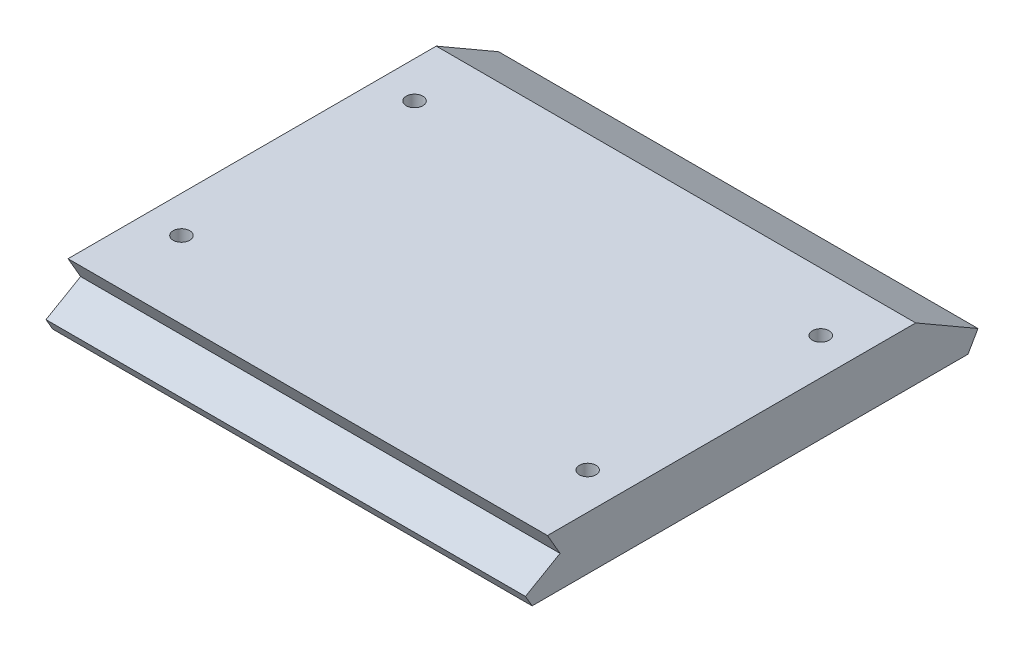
ISO-10303-21;
HEADER;
FILE_DESCRIPTION(('STEP AP214'),'2;1');
FILE_NAME('part.step','',(''),(''),'','','');
FILE_SCHEMA(('AUTOMOTIVE_DESIGN { 1 0 10303 214 1 1 1 1 }'));
ENDSEC;
DATA;
#1=APPLICATION_CONTEXT('core data for automotive mechanical design processes');
#2=APPLICATION_PROTOCOL_DEFINITION('international standard','automotive_design',2000,#1);
#3=PRODUCT_CONTEXT('',#1,'mechanical');
#4=PRODUCT('Part','Part','',(#3));
#5=PRODUCT_RELATED_PRODUCT_CATEGORY('part','',(#4));
#6=PRODUCT_DEFINITION_FORMATION('','',#4);
#7=PRODUCT_DEFINITION_CONTEXT('part definition',#1,'design');
#8=PRODUCT_DEFINITION('design','',#6,#7);
#9=PRODUCT_DEFINITION_SHAPE('','',#8);
#10=(LENGTH_UNIT() NAMED_UNIT(*) SI_UNIT(.MILLI.,.METRE.));
#11=(NAMED_UNIT(*) PLANE_ANGLE_UNIT() SI_UNIT($,.RADIAN.));
#12=(NAMED_UNIT(*) SI_UNIT($,.STERADIAN.) SOLID_ANGLE_UNIT());
#13=UNCERTAINTY_MEASURE_WITH_UNIT(LENGTH_MEASURE(1.E-05),#10,'distance_accuracy_value','');
#14=(GEOMETRIC_REPRESENTATION_CONTEXT(3) GLOBAL_UNCERTAINTY_ASSIGNED_CONTEXT((#13)) GLOBAL_UNIT_ASSIGNED_CONTEXT((#10,
#11,#12)) REPRESENTATION_CONTEXT('',''));
#15=CARTESIAN_POINT('',(0.,0.,0.));
#16=DIRECTION('',(0.,0.,1.));
#17=DIRECTION('',(1.,0.,0.));
#18=AXIS2_PLACEMENT_3D('',#15,#16,#17);
#19=CARTESIAN_POINT('',(36.,0.,0.));
#20=DIRECTION('',(0.,0.500000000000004,-0.866025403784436));
#21=DIRECTION('',(0.,0.866025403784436,0.500000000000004));
#22=AXIS2_PLACEMENT_3D('',#19,#20,#21);
#23=PLANE('',#22);
#24=DIRECTION('',(0.,-0.866025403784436,-0.500000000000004));
#25=VECTOR('',#24,1.);
#26=CARTESIAN_POINT('',(-36.,0.,0.));
#27=LINE('',#26,#25);
#28=CARTESIAN_POINT('',(-36.,1.73205080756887,1.00000000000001));
#29=VERTEX_POINT('',#28);
#30=CARTESIAN_POINT('',(-36.,0.,0.));
#31=VERTEX_POINT('',#30);
#32=EDGE_CURVE('E129',#29,#31,#27,.T.);
#33=ORIENTED_EDGE('',*,*,#32,.T.);
#34=DIRECTION('',(-1.,0.,0.));
#35=VECTOR('',#34,1.);
#36=CARTESIAN_POINT('',(36.,0.,0.));
#37=LINE('',#36,#35);
#38=CARTESIAN_POINT('',(36.,0.,0.));
#39=VERTEX_POINT('',#38);
#40=EDGE_CURVE('E11',#39,#31,#37,.T.);
#41=ORIENTED_EDGE('',*,*,#40,.F.);
#42=DIRECTION('',(0.,-0.866025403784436,-0.500000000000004));
#43=VECTOR('',#42,1.);
#44=CARTESIAN_POINT('',(36.,0.,0.));
#45=LINE('',#44,#43);
#46=CARTESIAN_POINT('',(36.,1.73205080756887,1.00000000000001));
#47=VERTEX_POINT('',#46);
#48=EDGE_CURVE('E142',#47,#39,#45,.T.);
#49=ORIENTED_EDGE('',*,*,#48,.F.);
#50=DIRECTION('',(-1.,0.,0.));
#51=VECTOR('',#50,1.);
#52=CARTESIAN_POINT('',(36.,1.73205080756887,1.00000000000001));
#53=LINE('',#52,#51);
#54=EDGE_CURVE('E125',#47,#29,#53,.T.);
#55=ORIENTED_EDGE('',*,*,#54,.T.);
#56=EDGE_LOOP('',(#33,#41,#49,#55));
#57=FACE_BOUND('',#56,.T.);
#58=ADVANCED_FACE('F36',(#57),#23,.F.);
#59=CARTESIAN_POINT('',(36.,0.,0.));
#60=DIRECTION('',(0.,1.,0.));
#61=DIRECTION('',(0.,0.,1.));
#62=AXIS2_PLACEMENT_3D('',#59,#60,#61);
#63=PLANE('',#62);
#64=DIRECTION('',(0.,0.,-1.));
#65=VECTOR('',#64,1.);
#66=CARTESIAN_POINT('',(-36.,0.,0.));
#67=LINE('',#66,#65);
#68=CARTESIAN_POINT('',(-36.,0.,-65.46));
#69=VERTEX_POINT('',#68);
#70=EDGE_CURVE('E132',#31,#69,#67,.T.);
#71=ORIENTED_EDGE('',*,*,#70,.T.);
#72=DIRECTION('',(-1.,0.,0.));
#73=VECTOR('',#72,1.);
#74=CARTESIAN_POINT('',(36.,0.,-65.46));
#75=LINE('',#74,#73);
#76=CARTESIAN_POINT('',(36.,0.,-65.46));
#77=VERTEX_POINT('',#76);
#78=EDGE_CURVE('E44',#77,#69,#75,.T.);
#79=ORIENTED_EDGE('',*,*,#78,.F.);
#80=DIRECTION('',(0.,0.,-1.));
#81=VECTOR('',#80,1.);
#82=CARTESIAN_POINT('',(36.,0.,0.));
#83=LINE('',#82,#81);
#84=EDGE_CURVE('E93',#39,#77,#83,.T.);
#85=ORIENTED_EDGE('',*,*,#84,.F.);
#86=ORIENTED_EDGE('',*,*,#40,.T.);
#87=EDGE_LOOP('',(#71,#79,#85,#86));
#88=FACE_BOUND('',#87,.T.);
#89=ADVANCED_FACE('F217',(#88),#63,.F.);
#90=CARTESIAN_POINT('',(36.,0.,-65.46));
#91=DIRECTION('',(0.,0.5,0.866025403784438));
#92=DIRECTION('',(0.,-0.866025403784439,0.5));
#93=AXIS2_PLACEMENT_3D('',#90,#91,#92);
#94=PLANE('',#93);
#95=DIRECTION('',(0.,0.866025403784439,-0.5));
#96=VECTOR('',#95,1.);
#97=CARTESIAN_POINT('',(-36.,0.,-65.46));
#98=LINE('',#97,#96);
#99=CARTESIAN_POINT('',(-36.,2.59807621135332,-66.96));
#100=VERTEX_POINT('',#99);
#101=EDGE_CURVE('E135',#69,#100,#98,.T.);
#102=ORIENTED_EDGE('',*,*,#101,.T.);
#103=DIRECTION('',(-1.,0.,0.));
#104=VECTOR('',#103,1.);
#105=CARTESIAN_POINT('',(36.,2.59807621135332,-66.96));
#106=LINE('',#105,#104);
#107=CARTESIAN_POINT('',(36.,2.59807621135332,-66.96));
#108=VERTEX_POINT('',#107);
#109=EDGE_CURVE('E146',#108,#100,#106,.T.);
#110=ORIENTED_EDGE('',*,*,#109,.F.);
#111=DIRECTION('',(0.,0.866025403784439,-0.5));
#112=VECTOR('',#111,1.);
#113=CARTESIAN_POINT('',(36.,0.,-65.46));
#114=LINE('',#113,#112);
#115=EDGE_CURVE('E154',#77,#108,#114,.T.);
#116=ORIENTED_EDGE('',*,*,#115,.F.);
#117=ORIENTED_EDGE('',*,*,#78,.T.);
#118=EDGE_LOOP('',(#102,#110,#116,#117));
#119=FACE_BOUND('',#118,.T.);
#120=ADVANCED_FACE('F152',(#119),#94,.F.);
#121=CARTESIAN_POINT('',(36.,2.59807621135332,-66.96));
#122=DIRECTION('',(0.,-0.866025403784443,0.499999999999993));
#123=DIRECTION('',(0.,-0.499999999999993,-0.866025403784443));
#124=AXIS2_PLACEMENT_3D('',#121,#122,#123);
#125=PLANE('',#124);
#126=DIRECTION('',(0.,0.499999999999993,0.866025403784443));
#127=VECTOR('',#126,1.);
#128=CARTESIAN_POINT('',(-36.,2.59807621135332,-66.96));
#129=LINE('',#128,#127);
#130=CARTESIAN_POINT('',(-36.,8.,-57.6035935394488));
#131=VERTEX_POINT('',#130);
#132=EDGE_CURVE('E137',#100,#131,#129,.T.);
#133=ORIENTED_EDGE('',*,*,#132,.T.);
#134=DIRECTION('',(-1.,0.,0.));
#135=VECTOR('',#134,1.);
#136=CARTESIAN_POINT('',(36.,8.,-57.6035935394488));
#137=LINE('',#136,#135);
#138=CARTESIAN_POINT('',(36.,8.,-57.6035935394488));
#139=VERTEX_POINT('',#138);
#140=EDGE_CURVE('E120',#139,#131,#137,.T.);
#141=ORIENTED_EDGE('',*,*,#140,.F.);
#142=DIRECTION('',(0.,0.499999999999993,0.866025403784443));
#143=VECTOR('',#142,1.);
#144=CARTESIAN_POINT('',(36.,2.59807621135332,-66.96));
#145=LINE('',#144,#143);
#146=EDGE_CURVE('E111',#108,#139,#145,.T.);
#147=ORIENTED_EDGE('',*,*,#146,.F.);
#148=ORIENTED_EDGE('',*,*,#109,.T.);
#149=EDGE_LOOP('',(#133,#141,#147,#148));
#150=FACE_BOUND('',#149,.T.);
#151=ADVANCED_FACE('F160',(#150),#125,.F.);
#152=CARTESIAN_POINT('',(36.,8.,-2.30940107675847));
#153=DIRECTION('',(0.,-1.,0.));
#154=DIRECTION('',(0.,0.,-1.));
#155=AXIS2_PLACEMENT_3D('',#152,#153,#154);
#156=PLANE('',#155);
#157=CARTESIAN_POINT('',(30.5,8.,-13.8411978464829));
#158=DIRECTION('',(0.,1.,0.));
#159=DIRECTION('',(0.,0.,1.));
#160=AXIS2_PLACEMENT_3D('',#157,#158,#159);
#161=CIRCLE('',#160,1.25);
#162=CARTESIAN_POINT('',(30.5,8.,-12.5911978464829));
#163=VERTEX_POINT('',#162);
#164=EDGE_CURVE('E185',#163,#163,#161,.T.);
#165=ORIENTED_EDGE('',*,*,#164,.F.);
#166=EDGE_LOOP('',(#165));
#167=FACE_BOUND('',#166,.T.);
#168=CARTESIAN_POINT('',(30.5,8.,-48.8411978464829));
#169=DIRECTION('',(0.,1.,0.));
#170=DIRECTION('',(0.,0.,1.));
#171=AXIS2_PLACEMENT_3D('',#168,#169,#170);
#172=CIRCLE('',#171,1.25);
#173=CARTESIAN_POINT('',(30.5,8.,-47.5911978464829));
#174=VERTEX_POINT('',#173);
#175=EDGE_CURVE('E179',#174,#174,#172,.T.);
#176=ORIENTED_EDGE('',*,*,#175,.F.);
#177=EDGE_LOOP('',(#176));
#178=FACE_BOUND('',#177,.T.);
#179=CARTESIAN_POINT('',(-30.5,8.,-13.8411978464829));
#180=DIRECTION('',(0.,1.,0.));
#181=DIRECTION('',(0.,0.,1.));
#182=AXIS2_PLACEMENT_3D('',#179,#180,#181);
#183=CIRCLE('',#182,1.25);
#184=CARTESIAN_POINT('',(-30.5,8.,-12.5911978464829));
#185=VERTEX_POINT('',#184);
#186=EDGE_CURVE('E173',#185,#185,#183,.T.);
#187=ORIENTED_EDGE('',*,*,#186,.F.);
#188=EDGE_LOOP('',(#187));
#189=FACE_BOUND('',#188,.T.);
#190=CARTESIAN_POINT('',(-30.5,8.,-48.8411978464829));
#191=DIRECTION('',(0.,1.,0.));
#192=DIRECTION('',(0.,0.,1.));
#193=AXIS2_PLACEMENT_3D('',#190,#191,#192);
#194=CIRCLE('',#193,1.25);
#195=CARTESIAN_POINT('',(-30.5,8.,-47.5911978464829));
#196=VERTEX_POINT('',#195);
#197=EDGE_CURVE('E167',#196,#196,#194,.T.);
#198=ORIENTED_EDGE('',*,*,#197,.F.);
#199=EDGE_LOOP('',(#198));
#200=FACE_BOUND('',#199,.T.);
#201=DIRECTION('',(0.,0.,1.));
#202=VECTOR('',#201,1.);
#203=CARTESIAN_POINT('',(-36.,8.,-2.30940107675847));
#204=LINE('',#203,#202);
#205=CARTESIAN_POINT('',(-36.,8.,-2.30940107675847));
#206=VERTEX_POINT('',#205);
#207=EDGE_CURVE('E119',#131,#206,#204,.T.);
#208=ORIENTED_EDGE('',*,*,#207,.T.);
#209=DIRECTION('',(-1.,0.,0.));
#210=VECTOR('',#209,1.);
#211=CARTESIAN_POINT('',(36.,8.,-2.30940107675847));
#212=LINE('',#211,#210);
#213=CARTESIAN_POINT('',(36.,8.,-2.30940107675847));
#214=VERTEX_POINT('',#213);
#215=EDGE_CURVE('E116',#214,#206,#212,.T.);
#216=ORIENTED_EDGE('',*,*,#215,.F.);
#217=DIRECTION('',(0.,0.,1.));
#218=VECTOR('',#217,1.);
#219=CARTESIAN_POINT('',(36.,8.,-2.30940107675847));
#220=LINE('',#219,#218);
#221=EDGE_CURVE('E105',#139,#214,#220,.T.);
#222=ORIENTED_EDGE('',*,*,#221,.F.);
#223=ORIENTED_EDGE('',*,*,#140,.T.);
#224=EDGE_LOOP('',(#208,#216,#222,#223));
#225=FACE_BOUND('',#224,.T.);
#226=ADVANCED_FACE('F117',(#167,#178,#189,#200,#225),#156,.F.);
#227=CARTESIAN_POINT('',(36.,4.7320508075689,-4.19615242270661));
#228=DIRECTION('',(0.,0.500000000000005,-0.866025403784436));
#229=DIRECTION('',(0.,0.866025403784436,0.500000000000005));
#230=AXIS2_PLACEMENT_3D('',#227,#228,#229);
#231=PLANE('',#230);
#232=DIRECTION('',(0.,-0.866025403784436,-0.500000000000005));
#233=VECTOR('',#232,1.);
#234=CARTESIAN_POINT('',(-36.,4.7320508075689,-4.19615242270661));
#235=LINE('',#234,#233);
#236=CARTESIAN_POINT('',(-36.,4.7320508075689,-4.19615242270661));
#237=VERTEX_POINT('',#236);
#238=EDGE_CURVE('E79',#206,#237,#235,.T.);
#239=ORIENTED_EDGE('',*,*,#238,.T.);
#240=DIRECTION('',(-1.,0.,0.));
#241=VECTOR('',#240,1.);
#242=CARTESIAN_POINT('',(36.,4.7320508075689,-4.19615242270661));
#243=LINE('',#242,#241);
#244=CARTESIAN_POINT('',(36.,4.7320508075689,-4.19615242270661));
#245=VERTEX_POINT('',#244);
#246=EDGE_CURVE('E121',#245,#237,#243,.T.);
#247=ORIENTED_EDGE('',*,*,#246,.F.);
#248=DIRECTION('',(0.,-0.866025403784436,-0.500000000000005));
#249=VECTOR('',#248,1.);
#250=CARTESIAN_POINT('',(36.,4.7320508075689,-4.19615242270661));
#251=LINE('',#250,#249);
#252=EDGE_CURVE('E109',#214,#245,#251,.T.);
#253=ORIENTED_EDGE('',*,*,#252,.F.);
#254=ORIENTED_EDGE('',*,*,#215,.T.);
#255=EDGE_LOOP('',(#239,#247,#253,#254));
#256=FACE_BOUND('',#255,.T.);
#257=ADVANCED_FACE('F123',(#256),#231,.F.);
#258=CARTESIAN_POINT('',(36.,1.73205080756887,1.00000000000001));
#259=DIRECTION('',(0.,-0.866025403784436,-0.500000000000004));
#260=DIRECTION('',(0.,0.500000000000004,-0.866025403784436));
#261=AXIS2_PLACEMENT_3D('',#258,#259,#260);
#262=PLANE('',#261);
#263=DIRECTION('',(0.,-0.500000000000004,0.866025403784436));
#264=VECTOR('',#263,1.);
#265=CARTESIAN_POINT('',(-36.,1.73205080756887,1.00000000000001));
#266=LINE('',#265,#264);
#267=EDGE_CURVE('E85',#237,#29,#266,.T.);
#268=ORIENTED_EDGE('',*,*,#267,.T.);
#269=ORIENTED_EDGE('',*,*,#54,.F.);
#270=DIRECTION('',(0.,-0.500000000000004,0.866025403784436));
#271=VECTOR('',#270,1.);
#272=CARTESIAN_POINT('',(36.,1.73205080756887,1.00000000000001));
#273=LINE('',#272,#271);
#274=EDGE_CURVE('E52',#245,#47,#273,.T.);
#275=ORIENTED_EDGE('',*,*,#274,.F.);
#276=ORIENTED_EDGE('',*,*,#246,.T.);
#277=EDGE_LOOP('',(#268,#269,#275,#276));
#278=FACE_BOUND('',#277,.T.);
#279=ADVANCED_FACE('F224',(#278),#262,.F.);
#280=CARTESIAN_POINT('',(36.,0.,0.));
#281=DIRECTION('',(-1.,0.,0.));
#282=DIRECTION('',(0.,0.,1.));
#283=AXIS2_PLACEMENT_3D('',#280,#281,#282);
#284=PLANE('',#283);
#285=ORIENTED_EDGE('',*,*,#48,.T.);
#286=ORIENTED_EDGE('',*,*,#84,.T.);
#287=ORIENTED_EDGE('',*,*,#115,.T.);
#288=ORIENTED_EDGE('',*,*,#146,.T.);
#289=ORIENTED_EDGE('',*,*,#221,.T.);
#290=ORIENTED_EDGE('',*,*,#252,.T.);
#291=ORIENTED_EDGE('',*,*,#274,.T.);
#292=EDGE_LOOP('',(#285,#286,#287,#288,#289,#290,#291));
#293=FACE_BOUND('',#292,.T.);
#294=ADVANCED_FACE('F107',(#293),#284,.F.);
#295=CARTESIAN_POINT('',(-36.,0.,0.));
#296=DIRECTION('',(-1.,0.,0.));
#297=DIRECTION('',(0.,0.,1.));
#298=AXIS2_PLACEMENT_3D('',#295,#296,#297);
#299=PLANE('',#298);
#300=ORIENTED_EDGE('',*,*,#32,.F.);
#301=ORIENTED_EDGE('',*,*,#267,.F.);
#302=ORIENTED_EDGE('',*,*,#238,.F.);
#303=ORIENTED_EDGE('',*,*,#207,.F.);
#304=ORIENTED_EDGE('',*,*,#132,.F.);
#305=ORIENTED_EDGE('',*,*,#101,.F.);
#306=ORIENTED_EDGE('',*,*,#70,.F.);
#307=EDGE_LOOP('',(#300,#301,#302,#303,#304,#305,#306));
#308=FACE_BOUND('',#307,.T.);
#309=ADVANCED_FACE('F158',(#308),#299,.T.);
#310=CARTESIAN_POINT('',(-30.5,1.5,-48.8411978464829));
#311=DIRECTION('',(0.,1.,0.));
#312=DIRECTION('',(0.,0.,1.));
#313=AXIS2_PLACEMENT_3D('',#310,#311,#312);
#314=CONICAL_SURFACE('',#313,1.25,1.02974425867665);
#315=CARTESIAN_POINT('',(-30.5,0.748924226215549,-48.8411978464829));
#316=VERTEX_POINT('',#315);
#317=VERTEX_LOOP('',#316);
#318=FACE_BOUND('',#317,.T.);
#319=CARTESIAN_POINT('',(-30.5,1.5,-48.8411978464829));
#320=DIRECTION('',(0.,1.,0.));
#321=DIRECTION('',(0.,0.,1.));
#322=AXIS2_PLACEMENT_3D('',#319,#320,#321);
#323=CIRCLE('',#322,1.25);
#324=CARTESIAN_POINT('',(-30.5,1.5,-47.5911978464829));
#325=VERTEX_POINT('',#324);
#326=EDGE_CURVE('E133',#325,#325,#323,.T.);
#327=ORIENTED_EDGE('',*,*,#326,.T.);
#328=EDGE_LOOP('',(#327));
#329=FACE_BOUND('',#328,.T.);
#330=ADVANCED_FACE('F203',(#318,#329),#314,.F.);
#331=CARTESIAN_POINT('',(-30.5,8.,-48.8411978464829));
#332=DIRECTION('',(0.,1.,0.));
#333=DIRECTION('',(0.,0.,1.));
#334=AXIS2_PLACEMENT_3D('',#331,#332,#333);
#335=CYLINDRICAL_SURFACE('',#334,1.25);
#336=ORIENTED_EDGE('',*,*,#326,.F.);
#337=EDGE_LOOP('',(#336));
#338=FACE_BOUND('',#337,.T.);
#339=ORIENTED_EDGE('',*,*,#197,.T.);
#340=EDGE_LOOP('',(#339));
#341=FACE_BOUND('',#340,.T.);
#342=ADVANCED_FACE('F200',(#338,#341),#335,.F.);
#343=CARTESIAN_POINT('',(-30.5,1.5,-13.8411978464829));
#344=DIRECTION('',(0.,1.,0.));
#345=DIRECTION('',(0.,0.,1.));
#346=AXIS2_PLACEMENT_3D('',#343,#344,#345);
#347=CONICAL_SURFACE('',#346,1.25,1.02974425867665);
#348=CARTESIAN_POINT('',(-30.5,0.748924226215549,-13.8411978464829));
#349=VERTEX_POINT('',#348);
#350=VERTEX_LOOP('',#349);
#351=FACE_BOUND('',#350,.T.);
#352=CARTESIAN_POINT('',(-30.5,1.5,-13.8411978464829));
#353=DIRECTION('',(0.,1.,0.));
#354=DIRECTION('',(0.,0.,1.));
#355=AXIS2_PLACEMENT_3D('',#352,#353,#354);
#356=CIRCLE('',#355,1.25);
#357=CARTESIAN_POINT('',(-30.5,1.5,-12.5911978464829));
#358=VERTEX_POINT('',#357);
#359=EDGE_CURVE('E170',#358,#358,#356,.T.);
#360=ORIENTED_EDGE('',*,*,#359,.T.);
#361=EDGE_LOOP('',(#360));
#362=FACE_BOUND('',#361,.T.);
#363=ADVANCED_FACE('F202',(#351,#362),#347,.F.);
#364=CARTESIAN_POINT('',(-30.5,8.,-13.8411978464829));
#365=DIRECTION('',(0.,1.,0.));
#366=DIRECTION('',(0.,0.,1.));
#367=AXIS2_PLACEMENT_3D('',#364,#365,#366);
#368=CYLINDRICAL_SURFACE('',#367,1.25);
#369=ORIENTED_EDGE('',*,*,#359,.F.);
#370=EDGE_LOOP('',(#369));
#371=FACE_BOUND('',#370,.T.);
#372=ORIENTED_EDGE('',*,*,#186,.T.);
#373=EDGE_LOOP('',(#372));
#374=FACE_BOUND('',#373,.T.);
#375=ADVANCED_FACE('F210',(#371,#374),#368,.F.);
#376=CARTESIAN_POINT('',(30.5,1.5,-48.8411978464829));
#377=DIRECTION('',(0.,1.,0.));
#378=DIRECTION('',(0.,0.,1.));
#379=AXIS2_PLACEMENT_3D('',#376,#377,#378);
#380=CONICAL_SURFACE('',#379,1.25,1.02974425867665);
#381=CARTESIAN_POINT('',(30.5,0.748924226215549,-48.8411978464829));
#382=VERTEX_POINT('',#381);
#383=VERTEX_LOOP('',#382);
#384=FACE_BOUND('',#383,.T.);
#385=CARTESIAN_POINT('',(30.5,1.5,-48.8411978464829));
#386=DIRECTION('',(0.,1.,0.));
#387=DIRECTION('',(0.,0.,1.));
#388=AXIS2_PLACEMENT_3D('',#385,#386,#387);
#389=CIRCLE('',#388,1.25);
#390=CARTESIAN_POINT('',(30.5,1.5,-47.5911978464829));
#391=VERTEX_POINT('',#390);
#392=EDGE_CURVE('E176',#391,#391,#389,.T.);
#393=ORIENTED_EDGE('',*,*,#392,.T.);
#394=EDGE_LOOP('',(#393));
#395=FACE_BOUND('',#394,.T.);
#396=ADVANCED_FACE('F300',(#384,#395),#380,.F.);
#397=CARTESIAN_POINT('',(30.5,8.,-48.8411978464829));
#398=DIRECTION('',(0.,1.,0.));
#399=DIRECTION('',(0.,0.,1.));
#400=AXIS2_PLACEMENT_3D('',#397,#398,#399);
#401=CYLINDRICAL_SURFACE('',#400,1.25);
#402=ORIENTED_EDGE('',*,*,#392,.F.);
#403=EDGE_LOOP('',(#402));
#404=FACE_BOUND('',#403,.T.);
#405=ORIENTED_EDGE('',*,*,#175,.T.);
#406=EDGE_LOOP('',(#405));
#407=FACE_BOUND('',#406,.T.);
#408=ADVANCED_FACE('F312',(#404,#407),#401,.F.);
#409=CARTESIAN_POINT('',(30.5,1.5,-13.8411978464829));
#410=DIRECTION('',(0.,1.,0.));
#411=DIRECTION('',(0.,0.,1.));
#412=AXIS2_PLACEMENT_3D('',#409,#410,#411);
#413=CONICAL_SURFACE('',#412,1.25,1.02974425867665);
#414=CARTESIAN_POINT('',(30.5,0.748924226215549,-13.8411978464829));
#415=VERTEX_POINT('',#414);
#416=VERTEX_LOOP('',#415);
#417=FACE_BOUND('',#416,.T.);
#418=CARTESIAN_POINT('',(30.5,1.5,-13.8411978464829));
#419=DIRECTION('',(0.,1.,0.));
#420=DIRECTION('',(0.,0.,1.));
#421=AXIS2_PLACEMENT_3D('',#418,#419,#420);
#422=CIRCLE('',#421,1.25);
#423=CARTESIAN_POINT('',(30.5,1.5,-12.5911978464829));
#424=VERTEX_POINT('',#423);
#425=EDGE_CURVE('E182',#424,#424,#422,.T.);
#426=ORIENTED_EDGE('',*,*,#425,.T.);
#427=EDGE_LOOP('',(#426));
#428=FACE_BOUND('',#427,.T.);
#429=ADVANCED_FACE('F322',(#417,#428),#413,.F.);
#430=CARTESIAN_POINT('',(30.5,8.,-13.8411978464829));
#431=DIRECTION('',(0.,1.,0.));
#432=DIRECTION('',(0.,0.,1.));
#433=AXIS2_PLACEMENT_3D('',#430,#431,#432);
#434=CYLINDRICAL_SURFACE('',#433,1.25);
#435=ORIENTED_EDGE('',*,*,#425,.F.);
#436=EDGE_LOOP('',(#435));
#437=FACE_BOUND('',#436,.T.);
#438=ORIENTED_EDGE('',*,*,#164,.T.);
#439=EDGE_LOOP('',(#438));
#440=FACE_BOUND('',#439,.T.);
#441=ADVANCED_FACE('F189',(#437,#440),#434,.F.);
#442=CLOSED_SHELL('',(#58,#89,#120,#151,#226,#257,#279,#294,#309,#330,#342,#363,#375,#396,#408,
#429,#441));
#443=MANIFOLD_SOLID_BREP('B2',#442);
#444=ADVANCED_BREP_SHAPE_REPRESENTATION('',(#18,#443),#14);
#445=SHAPE_DEFINITION_REPRESENTATION(#9,#444);
ENDSEC;
END-ISO-10303-21;
